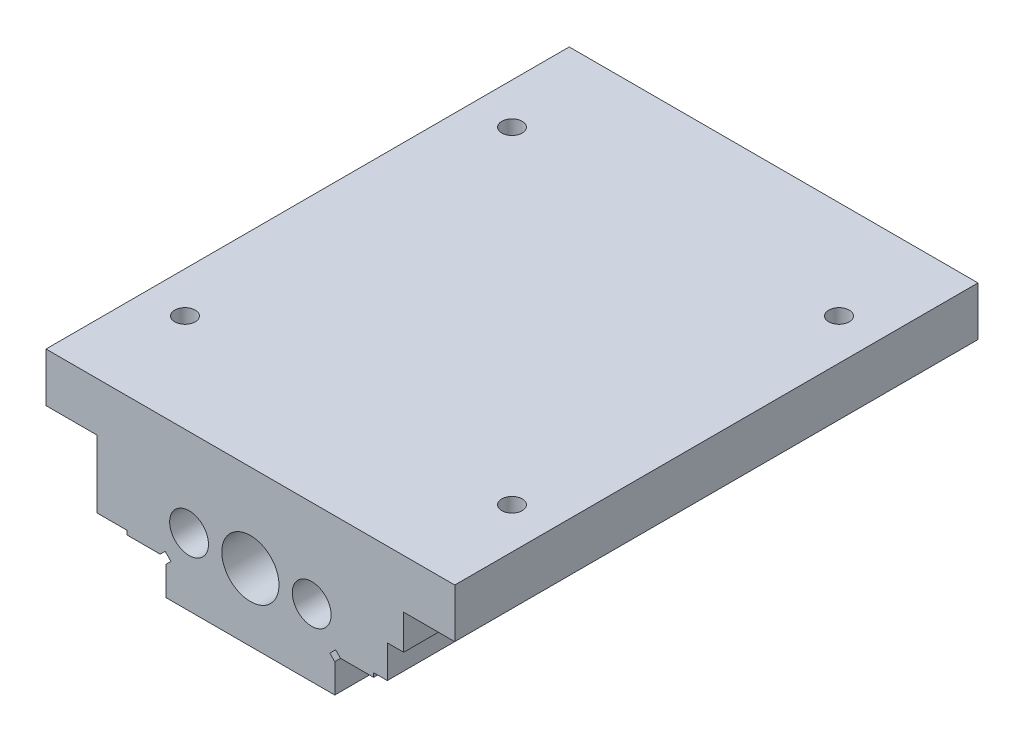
from build123d import *

# Parameters (mm, degrees)
EXTRUSION1_DEPTH           = 128
ESQUISSE2_W                = 4
ESQUISSE2_H                = 8
ENL_V_MAT_EXTRU_2_DEPTH    = 138.145907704
ESQUISSE21_W               = 100
ESQUISSE21_H               = 12
EXTRUSION2_DEPTH           = 128
ESQUISSE6_R                = 2.5
ENL_V_MAT_EXTRU_4_DEPTH    = 143.576295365
ESQUISSE7_R                = 10.2
ENL_V_MAT_EXTRU_5_DEPTH    = 140.857069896
R_P_TITION_LIN_AIRE2_COUNT = 2
R_P_TITION_LIN_AIRE2_PITCH = 80
R_P_TITION_LIN_AIRE4_COUNT = 5
R_P_TITION_LIN_AIRE4_PITCH = 25
ESQUISSE15_R               = 1.2
ENL_V_MAT_EXTRU_10_DEPTH   = 20.7
SYM_TRIE3_COPY_1_SKETCH_R  = 2.5
SYM_TRIE3_COPY_1_DEPTH     = 143.576295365
SYM_TRIE3_COPY_2_SKETCH_R  = 10.2
SYM_TRIE3_COPY_2_DEPTH     = 140.857069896


with BuildPart() as part:
    # Esquisse1 → Extrusion1 (new body)
    with BuildSketch(Plane.XY):
        Polygon((28.95, 17.5), (-28.95, 17.5), (-28.95, 15), (-34.35, 15), (-34.35, 20), (-45, 20), (-45, 9.5), (-37.5, 9.5), (-37.5, -7), (-30.15, -7), (-30.15, -8), (-22.054213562, -8), (-20.852132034, -6.797918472), (-19.437918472, -8.212132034), (-20.64, -9.414213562), (-20.64, -16.5), (20.64, -16.5), (20.64, -9.414213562), (19.437918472, -8.212132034), (20.852132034, -6.797918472), (22.054213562, -8), (30.15, -8), (30.15, -7), (37.5, -7), (37.5, 9.5), (45, 9.5), (45, 20), (34.35, 20), (34.35, 15), (28.95, 15), align=None)
    extrude(amount=EXTRUSION1_DEPTH)

    # Esquisse2 → Enl_v. mat.-Extru.2 (cut, through all)
    with BuildSketch(Plane.XY):
        with Locations((35.5, -3)):
            Rectangle(ESQUISSE2_W, ESQUISSE2_H)
    extrude(amount=ENL_V_MAT_EXTRU_2_DEPTH, mode=Mode.SUBTRACT)

    # Esquisse21 → Extrusion2 (add)
    with BuildSketch(Plane.XY):
        with Locations((0, 15.5)):
            Rectangle(ESQUISSE21_W, ESQUISSE21_H)
    extrude(amount=EXTRUSION2_DEPTH)

    # Esquisse3 → Enl_vement de mati_re-R_volution1 (revolve, cut)
    with BuildSketch(Plane(origin=(0, 0, 0), x_dir=(0, 0, -1), z_dir=(1, 0, 0)), mode=Mode.PRIVATE) as enl_vement_de_mati_re_r_volution1_sk:
        Polygon((0, 0), (0, 19.75), (-15, 19.75), (-15, 19.25), (-16, 19.25), (-16, 10), (-41, 10), (-41, 9.5), (-53, 9.5), (-53, 7), (-128, 7), (-128, 0), align=None)
    revolve(enl_vement_de_mati_re_r_volution1_sk.sketch.rotate(Axis((0, 0, 0), (0, 0, 1)), 90), axis=Axis((0, 0, 0), (0, 0, 1)), mode=Mode.SUBTRACT)

    # Esquisse4 → Enl_vement de mati_re-R_volution2 (revolve, cut)
    with BuildSketch(Plane(origin=(0, 0, 0), x_dir=(-0.8660254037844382, -0.500000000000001, 0), z_dir=(-0.500000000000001, 0.8660254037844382, 0)), mode=Mode.PRIVATE) as enl_vement_de_mati_re_r_volution2_sk:
        Polygon((14.5, 16), (16.15, 16), (16.15, 28.047372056), (14.5, 29), align=None)
    enl_vement_de_mati_re_r_volution2 = revolve(enl_vement_de_mati_re_r_volution2_sk.sketch.rotate(Axis((-12.557368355, -7.25, -50.196355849), (0, 0, 1)), 330), axis=Axis((-12.557368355, -7.25, -50.196355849), (0, 0, 1)), mode=Mode.SUBTRACT)

    # Sym_trie1: Enl_vement de mati_re-R_volution2 across plane
    add(enl_vement_de_mati_re_r_volution2.mirror(Plane.ZX), mode=Mode.SUBTRACT)

    # Sym_trie2: Enl_vement de mati_re-R_volution2 across plane
    add(enl_vement_de_mati_re_r_volution2.mirror(Plane(origin=(0, 0, 0), x_dir=(0, 0, 1), z_dir=(1, 0, 0))), mode=Mode.SUBTRACT)

    # Sym_trie2 copy 1 sketch → Sym_trie2 copy 1 (revolve, cut)
    with BuildSketch(Plane(origin=(0, 0, 0), x_dir=(0.8660254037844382, 0.500000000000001, 0), z_dir=(0.500000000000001, -0.8660254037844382, 0))):
        Polygon((14.5, 16), (16.15, 16), (16.15, 28.047372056), (14.5, 29), align=None)
    revolve(axis=Axis((12.557368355, 7.25, -50.196355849), (0, 0, 1)), mode=Mode.SUBTRACT)

    # Esquisse6 → Enl_v. mat.-Extru.4 (cut, through all)
    with BuildSketch(Plane(origin=(0, 21.5, 0), x_dir=(-1, 0, 0), z_dir=(0, 1, 0))):
        with Locations(Location((40, 24, 0), (0, 0, 90))):
            Circle(ESQUISSE6_R)
    enl_v_mat_extru_4 = extrude(amount=-ENL_V_MAT_EXTRU_4_DEPTH, mode=Mode.SUBTRACT)

    # Esquisse7 → Enl_v. mat.-Extru.5 (cut, through all)
    with BuildSketch(Plane.XZ.offset(-9.5)):
        with Locations((-46.7, 24)):
            Circle(ESQUISSE7_R)
    enl_v_mat_extru_5 = extrude(amount=ENL_V_MAT_EXTRU_5_DEPTH, mode=Mode.SUBTRACT)

    # R_p_tition lin_aire2: Enl_v. mat.-Extru.4, Enl_v. mat.-Extru.5 ×2
    with Locations(*[(0, 0, i * R_P_TITION_LIN_AIRE2_PITCH) for i in range(1, R_P_TITION_LIN_AIRE2_COUNT)]):
        add(enl_v_mat_extru_4, mode=Mode.SUBTRACT)
        add(enl_v_mat_extru_5, mode=Mode.SUBTRACT)

    # Esquisse8 → Enl_vement de mati_re-R_volution3 (revolve, cut)
    with BuildSketch(Plane(origin=(0, 0, 0), x_dir=(1, 0, 0), z_dir=(0, 1, 0))):
        Polygon((-15, -128), (-10.25, -128), (-10.25, -78), (-15, -75.257586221), align=None)
    enl_vement_de_mati_re_r_volution3 = revolve(axis=Axis((-15, 0, 152.24018206), (0, 0, -1)), mode=Mode.SUBTRACT)

    # Esquisse12 → Enl_vement de mati_re-R_volution4 (revolve, cut)
    with BuildSketch(Plane.XY.offset(14), mode=Mode.PRIVATE) as enl_vement_de_mati_re_r_volution4_sk:
        Polygon((-25.49, 5), (-24.24, 4.278312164), (-24.24, -8), (-25.49, -8), align=None)
    enl_vement_de_mati_re_r_volution4 = revolve(enl_vement_de_mati_re_r_volution4_sk.sketch.rotate(Axis((-25.49, -22.99033905, 14), (0, 1, 0)), 90), axis=Axis((-25.49, -22.99033905, 14), (0, 1, 0)), mode=Mode.SUBTRACT)

    # R_p_tition lin_aire4: Enl_vement de mati_re-R_volution4 ×5
    with Locations(*[(0, 0, i * R_P_TITION_LIN_AIRE4_PITCH) for i in range(1, R_P_TITION_LIN_AIRE4_COUNT)]):
        add(enl_vement_de_mati_re_r_volution4, mode=Mode.SUBTRACT)

    # Esquisse15 → Enl_v. mat.-Extru.10 (cut)
    with BuildSketch(Plane.XZ.offset(8)):
        with Locations((-25.49, 76.5)):
            Circle(ESQUISSE15_R)
    enl_v_mat_extru_10 = extrude(amount=-ENL_V_MAT_EXTRU_10_DEPTH, mode=Mode.SUBTRACT)

    # Sym_trie3: Enl_v. mat.-Extru.4, Enl_v. mat.-Extru.5, Enl_vement de mati_re-R_volution3, Enl_vement de mati_re-R_volution4, Enl_v. mat.-Extru.10 across plane
    add(enl_v_mat_extru_4.mirror(Plane(origin=(0, 0, 0), x_dir=(0, 0, 1), z_dir=(1, 0, 0))), mode=Mode.SUBTRACT)
    add(enl_v_mat_extru_5.mirror(Plane(origin=(0, 0, 0), x_dir=(0, 0, 1), z_dir=(1, 0, 0))), mode=Mode.SUBTRACT)
    add(enl_vement_de_mati_re_r_volution3.mirror(Plane(origin=(0, 0, 0), x_dir=(0, 0, 1), z_dir=(1, 0, 0))), mode=Mode.SUBTRACT)
    add(enl_vement_de_mati_re_r_volution4.mirror(Plane(origin=(0, 0, 0), x_dir=(0, 0, 1), z_dir=(1, 0, 0))), mode=Mode.SUBTRACT)
    add(enl_v_mat_extru_10.mirror(Plane(origin=(0, 0, 0), x_dir=(0, 0, 1), z_dir=(1, 0, 0))), mode=Mode.SUBTRACT)

    # Sym_trie3 copy 1 sketch → Sym_trie3 copy 1 (cut, through all)
    with BuildSketch(Plane(origin=(0, 21.5, 80), x_dir=(1, 0, 0), z_dir=(0, 1, 0))):
        with Locations((40, -24)):
            Circle(SYM_TRIE3_COPY_1_SKETCH_R)
    extrude(amount=-SYM_TRIE3_COPY_1_DEPTH, mode=Mode.SUBTRACT)

    # Sym_trie3 copy 2 sketch → Sym_trie3 copy 2 (cut, through all)
    with BuildSketch(Plane(origin=(0, 9.5, 80), x_dir=(-1, 0, 0), z_dir=(0, -1, 0))):
        with Locations((-46.7, -24)):
            Circle(SYM_TRIE3_COPY_2_SKETCH_R)
    extrude(amount=SYM_TRIE3_COPY_2_DEPTH, mode=Mode.SUBTRACT)

    # Sym_trie3 copy 3 sketch → Sym_trie3 copy 3 (revolve, cut)
    with BuildSketch(Plane(origin=(0, 0, 39), x_dir=(-1, 0, 0), z_dir=(0, 0, 1))):
        Polygon((-25.49, -5), (-24.24, -4.278312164), (-24.24, 8), (-25.49, 8), align=None)
    revolve(axis=Axis((25.49, -22.99033905, 39), (0, -1, 0)), mode=Mode.SUBTRACT)

    # Sym_trie3 copy 4 sketch → Sym_trie3 copy 4 (revolve, cut)
    with BuildSketch(Plane(origin=(0, 0, 64), x_dir=(-1, 0, 0), z_dir=(0, 0, 1))):
        Polygon((-25.49, -5), (-24.24, -4.278312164), (-24.24, 8), (-25.49, 8), align=None)
    revolve(axis=Axis((25.49, -22.99033905, 64), (0, -1, 0)), mode=Mode.SUBTRACT)

    # Sym_trie3 copy 5 sketch → Sym_trie3 copy 5 (revolve, cut)
    with BuildSketch(Plane(origin=(0, 0, 89), x_dir=(-1, 0, 0), z_dir=(0, 0, 1))):
        Polygon((-25.49, -5), (-24.24, -4.278312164), (-24.24, 8), (-25.49, 8), align=None)
    revolve(axis=Axis((25.49, -22.99033905, 89), (0, -1, 0)), mode=Mode.SUBTRACT)

    # Sym_trie3 copy 6 sketch → Sym_trie3 copy 6 (revolve, cut)
    with BuildSketch(Plane(origin=(0, 0, 114), x_dir=(-1, 0, 0), z_dir=(0, 0, 1))):
        Polygon((-25.49, -5), (-24.24, -4.278312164), (-24.24, 8), (-25.49, 8), align=None)
    revolve(axis=Axis((25.49, -22.99033905, 114), (0, -1, 0)), mode=Mode.SUBTRACT)


solid = part.part
